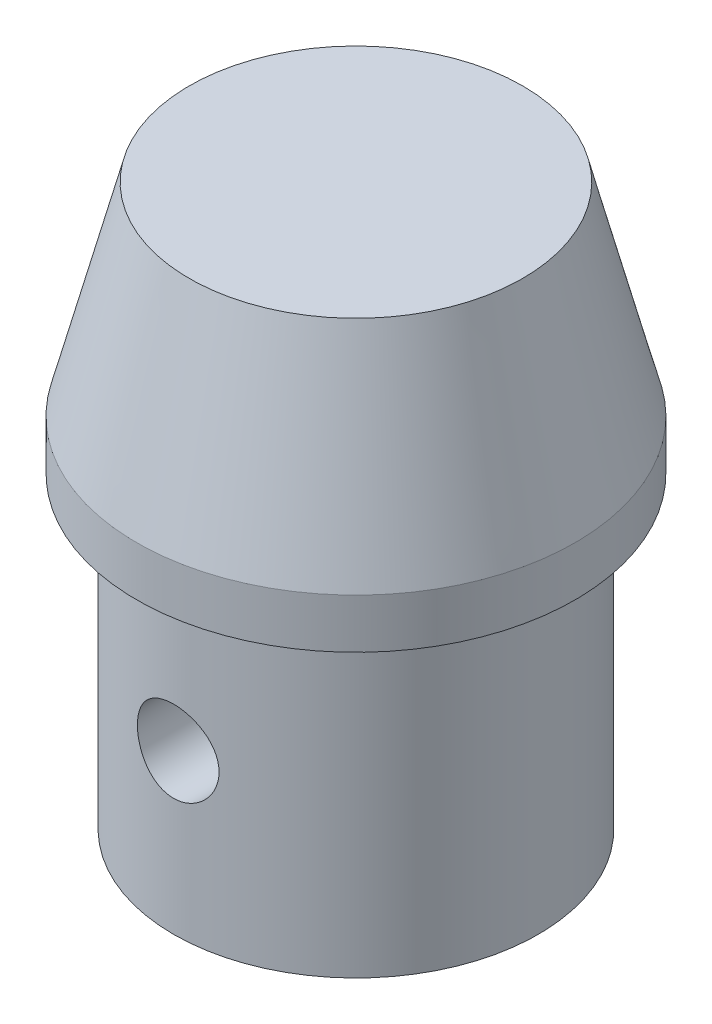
ISO-10303-21;
HEADER;
FILE_DESCRIPTION(('STEP AP214'),'2;1');
FILE_NAME('part.step','',(''),(''),'','','');
FILE_SCHEMA(('AUTOMOTIVE_DESIGN { 1 0 10303 214 1 1 1 1 }'));
ENDSEC;
DATA;
#1=APPLICATION_CONTEXT('core data for automotive mechanical design processes');
#2=APPLICATION_PROTOCOL_DEFINITION('international standard','automotive_design',2000,#1);
#3=PRODUCT_CONTEXT('',#1,'mechanical');
#4=PRODUCT('Part','Part','',(#3));
#5=PRODUCT_RELATED_PRODUCT_CATEGORY('part','',(#4));
#6=PRODUCT_DEFINITION_FORMATION('','',#4);
#7=PRODUCT_DEFINITION_CONTEXT('part definition',#1,'design');
#8=PRODUCT_DEFINITION('design','',#6,#7);
#9=PRODUCT_DEFINITION_SHAPE('','',#8);
#10=(LENGTH_UNIT() NAMED_UNIT(*) SI_UNIT(.MILLI.,.METRE.));
#11=(NAMED_UNIT(*) PLANE_ANGLE_UNIT() SI_UNIT($,.RADIAN.));
#12=(NAMED_UNIT(*) SI_UNIT($,.STERADIAN.) SOLID_ANGLE_UNIT());
#13=UNCERTAINTY_MEASURE_WITH_UNIT(LENGTH_MEASURE(1.E-05),#10,'distance_accuracy_value','');
#14=(GEOMETRIC_REPRESENTATION_CONTEXT(3) GLOBAL_UNCERTAINTY_ASSIGNED_CONTEXT((#13)) GLOBAL_UNIT_ASSIGNED_CONTEXT((#10,
#11,#12)) REPRESENTATION_CONTEXT('',''));
#15=CARTESIAN_POINT('',(0.,0.,0.));
#16=DIRECTION('',(0.,0.,1.));
#17=DIRECTION('',(1.,0.,0.));
#18=AXIS2_PLACEMENT_3D('',#15,#16,#17);
#19=CARTESIAN_POINT('',(0.,0.,0.));
#20=DIRECTION('',(0.,-1.,0.));
#21=DIRECTION('',(0.,0.,-1.));
#22=AXIS2_PLACEMENT_3D('',#19,#20,#21);
#23=PLANE('',#22);
#24=CARTESIAN_POINT('',(0.,0.,0.));
#25=DIRECTION('',(0.,-1.,0.));
#26=DIRECTION('',(0.,0.,-1.));
#27=AXIS2_PLACEMENT_3D('',#24,#25,#26);
#28=CIRCLE('',#27,7.2898);
#29=CARTESIAN_POINT('',(0.,0.,-7.2898));
#30=VERTEX_POINT('',#29);
#31=EDGE_CURVE('E10',#30,#30,#28,.T.);
#32=ORIENTED_EDGE('',*,*,#31,.T.);
#33=EDGE_LOOP('',(#32));
#34=FACE_BOUND('',#33,.T.);
#35=ADVANCED_FACE('F32',(#34),#23,.T.);
#36=CARTESIAN_POINT('',(0.,0.,0.));
#37=DIRECTION('',(0.,-1.,0.));
#38=DIRECTION('',(0.,0.,-1.));
#39=AXIS2_PLACEMENT_3D('',#36,#37,#38);
#40=CYLINDRICAL_SURFACE('',#39,7.2898);
#41=CARTESIAN_POINT('',(0.,7.9756,-7.2898));
#42=CARTESIAN_POINT('',(0.0904583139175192,7.9755969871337,-7.28979834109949));
#43=CARTESIAN_POINT('',(0.180952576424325,7.96805351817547,-7.28809921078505));
#44=CARTESIAN_POINT('',(0.359367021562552,7.93811242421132,-7.28148523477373));
#45=CARTESIAN_POINT('',(0.447285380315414,7.91570452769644,-7.27656816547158));
#46=CARTESIAN_POINT('',(0.61794409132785,7.85677446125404,-7.26406532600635));
#47=CARTESIAN_POINT('',(0.700689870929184,7.82026738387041,-7.25648241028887));
#48=CARTESIAN_POINT('',(0.858879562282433,7.73422399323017,-7.23946458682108));
#49=CARTESIAN_POINT('',(0.934323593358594,7.6846878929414,-7.23002970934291));
#50=CARTESIAN_POINT('',(1.07703522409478,7.57311414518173,-7.21016326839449));
#51=CARTESIAN_POINT('',(1.14416291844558,7.51089982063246,-7.19971885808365));
#52=CARTESIAN_POINT('',(1.26712280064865,7.37611479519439,-7.17910019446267));
#53=CARTESIAN_POINT('',(1.32295394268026,7.30354313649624,-7.16892596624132));
#54=CARTESIAN_POINT('',(1.42235946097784,7.14906097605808,-7.14987255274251));
#55=CARTESIAN_POINT('',(1.46578372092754,7.0670516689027,-7.14100980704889));
#56=CARTESIAN_POINT('',(1.53817952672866,6.89666833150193,-7.12576771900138));
#57=CARTESIAN_POINT('',(1.56715288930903,6.80829510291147,-7.11938806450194));
#58=CARTESIAN_POINT('',(1.60935974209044,6.62921353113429,-7.10996552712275));
#59=CARTESIAN_POINT('',(1.62284155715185,6.53856654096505,-7.10687006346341));
#60=CARTESIAN_POINT('',(1.63445497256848,6.35624858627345,-7.10420855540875));
#61=CARTESIAN_POINT('',(1.63258855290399,6.26457775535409,-7.10464205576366));
#62=CARTESIAN_POINT('',(1.61375804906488,6.08466911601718,-7.1089419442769));
#63=CARTESIAN_POINT('',(1.59708356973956,5.99639918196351,-7.11274247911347));
#64=CARTESIAN_POINT('',(1.54956958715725,5.82394227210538,-7.12324396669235));
#65=CARTESIAN_POINT('',(1.51872925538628,5.73975553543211,-7.12994508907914));
#66=CARTESIAN_POINT('',(1.4434961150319,5.57704651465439,-7.14555689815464));
#67=CARTESIAN_POINT('',(1.3989929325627,5.49857705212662,-7.15448546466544));
#68=CARTESIAN_POINT('',(1.29777491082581,5.35011303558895,-7.17353531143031));
#69=CARTESIAN_POINT('',(1.24105833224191,5.28011969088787,-7.18365676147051));
#70=CARTESIAN_POINT('',(1.11549558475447,5.148928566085,-7.20423368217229));
#71=CARTESIAN_POINT('',(1.04640343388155,5.08796634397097,-7.21469152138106));
#72=CARTESIAN_POINT('',(0.898856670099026,4.97845473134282,-7.23455410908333));
#73=CARTESIAN_POINT('',(0.820401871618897,4.92990558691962,-7.24395883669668));
#74=CARTESIAN_POINT('',(0.656061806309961,4.84653573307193,-7.26068838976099));
#75=CARTESIAN_POINT('',(0.570159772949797,4.81174703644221,-7.26800835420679));
#76=CARTESIAN_POINT('',(0.393528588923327,4.75716428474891,-7.27970764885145));
#77=CARTESIAN_POINT('',(0.302800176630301,4.73736794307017,-7.28408742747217));
#78=CARTESIAN_POINT('',(0.121111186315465,4.71367711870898,-7.28934864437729));
#79=CARTESIAN_POINT('',(0.0301945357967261,4.70946102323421,-7.29030082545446));
#80=CARTESIAN_POINT('',(-0.151044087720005,4.71617703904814,-7.28879830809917));
#81=CARTESIAN_POINT('',(-0.24136610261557,4.72710807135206,-7.28634385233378));
#82=CARTESIAN_POINT('',(-0.417777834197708,4.76354156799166,-7.27834860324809));
#83=CARTESIAN_POINT('',(-0.503904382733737,4.78887428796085,-7.27284378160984));
#84=CARTESIAN_POINT('',(-0.670685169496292,4.85320279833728,-7.25936443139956));
#85=CARTESIAN_POINT('',(-0.751338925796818,4.89219979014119,-7.25138968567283));
#86=CARTESIAN_POINT('',(-0.906206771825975,4.98341259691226,-7.2336812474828));
#87=CARTESIAN_POINT('',(-0.980307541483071,5.03581598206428,-7.22392320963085));
#88=CARTESIAN_POINT('',(-1.11877886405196,5.15210820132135,-7.2037783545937));
#89=CARTESIAN_POINT('',(-1.18314808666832,5.21599860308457,-7.19339145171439));
#90=CARTESIAN_POINT('',(-1.30160920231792,5.35493010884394,-7.17291353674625));
#91=CARTESIAN_POINT('',(-1.35547789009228,5.43016321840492,-7.16283215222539));
#92=CARTESIAN_POINT('',(-1.44981794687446,5.58879674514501,-7.14433568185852));
#93=CARTESIAN_POINT('',(-1.49028990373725,5.67219680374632,-7.13592052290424));
#94=CARTESIAN_POINT('',(-1.55640821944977,5.84434529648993,-7.12179200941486));
#95=CARTESIAN_POINT('',(-1.58213927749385,5.93305987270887,-7.11606325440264));
#96=CARTESIAN_POINT('',(-1.61829044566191,6.11369910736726,-7.10793005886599));
#97=CARTESIAN_POINT('',(-1.62871313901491,6.20562322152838,-7.10552505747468));
#98=CARTESIAN_POINT('',(-1.63383773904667,6.3878186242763,-7.10434820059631));
#99=CARTESIAN_POINT('',(-1.62889394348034,6.47807959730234,-7.10549446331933));
#100=CARTESIAN_POINT('',(-1.60422089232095,6.65644704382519,-7.11110515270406));
#101=CARTESIAN_POINT('',(-1.58449182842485,6.7445535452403,-7.115569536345));
#102=CARTESIAN_POINT('',(-1.53098309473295,6.91581341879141,-7.1272726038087));
#103=CARTESIAN_POINT('',(-1.49725731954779,6.99898440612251,-7.13450063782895));
#104=CARTESIAN_POINT('',(-1.41675797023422,7.15853942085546,-7.1509202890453));
#105=CARTESIAN_POINT('',(-1.36998296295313,7.23492270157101,-7.16011212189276));
#106=CARTESIAN_POINT('',(-1.2635478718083,7.38047535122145,-7.17966655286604));
#107=CARTESIAN_POINT('',(-1.20363630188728,7.4494580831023,-7.19004979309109));
#108=CARTESIAN_POINT('',(-1.07313544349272,7.57650684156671,-7.21068097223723));
#109=CARTESIAN_POINT('',(-1.00254368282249,7.63457033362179,-7.22092887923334));
#110=CARTESIAN_POINT('',(-0.851517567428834,7.73889825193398,-7.24030184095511));
#111=CARTESIAN_POINT('',(-0.770961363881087,7.78498970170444,-7.24940954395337));
#112=CARTESIAN_POINT('',(-0.603056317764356,7.86290460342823,-7.26530063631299));
#113=CARTESIAN_POINT('',(-0.515713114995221,7.89473975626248,-7.27208593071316));
#114=CARTESIAN_POINT('',(-0.35693107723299,7.9377098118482,-7.28138876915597));
#115=CARTESIAN_POINT('',(-0.286336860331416,7.95189098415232,-7.28452312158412));
#116=CARTESIAN_POINT('',(-0.143835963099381,7.97083704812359,-7.28872934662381));
#117=CARTESIAN_POINT('',(-0.0719293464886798,7.97560239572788,-7.28980131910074));
#118=CARTESIAN_POINT('',(0.,7.9756,-7.2898));
#119=B_SPLINE_CURVE_WITH_KNOTS('',3,(#41,#42,#43,#44,#45,#46,#47,#48,#49,#50,#51,#52,#53,#54,
#55,#56,#57,#58,#59,#60,#61,#62,#63,#64,#65,#66,#67,#68,#69,#70,#71,#72,#73,#74,#75,#76,#77,#78,
#79,#80,#81,#82,#83,#84,#85,#86,#87,#88,#89,#90,#91,#92,#93,#94,#95,#96,#97,#98,#99,#100,#101,
#102,#103,#104,#105,#106,#107,#108,#109,#110,#111,#112,#113,#114,#115,#116,#117,#118),
.UNSPECIFIED.,.T.,.F.,(4,2,2,2,2,2,2,2,2,2,2,2,2,2,2,2,2,2,2,2,2,2,2,2,2,2,2,2,2,2,2,2,2,2,2,2,
2,2,4),(0.,0.271111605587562,0.542410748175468,0.813420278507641,1.08442537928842,
1.35950292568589,1.63460592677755,1.91290875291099,2.19117658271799,2.46491874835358,
2.73862560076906,3.0070945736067,3.27557925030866,3.54629261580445,3.81704455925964,
4.09393876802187,4.37083846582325,4.64837861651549,4.92587642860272,5.19761298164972,
5.46933017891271,5.73790929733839,6.00651203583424,6.27910063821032,6.55172646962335,
6.82963268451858,7.10752670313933,7.38380753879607,7.66004174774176,7.92995458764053,
8.19986392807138,8.46874348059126,8.73765257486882,9.01224638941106,9.28690386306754,
9.56533299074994,9.84353317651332,10.0591222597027,10.2747009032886),.UNSPECIFIED.);
#120=CARTESIAN_POINT('',(0.,7.9756,-7.2898));
#121=VERTEX_POINT('',#120);
#122=EDGE_CURVE('E35',#121,#121,#119,.T.);
#123=ORIENTED_EDGE('',*,*,#122,.F.);
#124=EDGE_LOOP('',(#123));
#125=FACE_BOUND('',#124,.T.);
#126=CARTESIAN_POINT('',(1.63195,6.34365000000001,7.10478171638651));
#127=CARTESIAN_POINT('',(1.63194696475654,6.43407629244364,7.10478354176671));
#128=CARTESIAN_POINT('',(1.62440865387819,6.52453858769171,7.10652688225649));
#129=CARTESIAN_POINT('',(1.59448990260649,6.7028866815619,7.11329830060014));
#130=CARTESIAN_POINT('',(1.57209906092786,6.7907706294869,7.11832868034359));
#131=CARTESIAN_POINT('',(1.51321884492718,6.9613564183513,7.13107655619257));
#132=CARTESIAN_POINT('',(1.47674536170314,7.04406397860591,7.13879102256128));
#133=CARTESIAN_POINT('',(1.39078118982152,7.20218909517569,7.15603418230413));
#134=CARTESIAN_POINT('',(1.34129063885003,7.27760672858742,7.16556285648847));
#135=CARTESIAN_POINT('',(1.22976384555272,7.42034591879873,7.18554913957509));
#136=CARTESIAN_POINT('',(1.16754068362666,7.48751972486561,7.19601910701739));
#137=CARTESIAN_POINT('',(1.0327183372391,7.61056924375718,7.21660023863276));
#138=CARTESIAN_POINT('',(0.960118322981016,7.66644405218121,7.22671137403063));
#139=CARTESIAN_POINT('',(0.805609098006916,7.76589708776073,7.24557052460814));
#140=CARTESIAN_POINT('',(0.723605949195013,7.80933272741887,7.25430225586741));
#141=CARTESIAN_POINT('',(0.553235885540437,7.88175124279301,7.26927895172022));
#142=CARTESIAN_POINT('',(0.464869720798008,7.91073581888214,7.27552420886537));
#143=CARTESIAN_POINT('',(0.285818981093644,7.95296339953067,7.28473694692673));
#144=CARTESIAN_POINT('',(0.19519613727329,7.96645660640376,7.28775646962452));
#145=CARTESIAN_POINT('',(0.0129261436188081,7.97810118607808,7.29035799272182));
#146=CARTESIAN_POINT('',(-0.0787208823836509,7.97625439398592,7.28994040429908));
#147=CARTESIAN_POINT('',(-0.258711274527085,7.95745675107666,7.28575436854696));
#148=CARTESIAN_POINT('',(-0.347084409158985,7.94077564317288,7.2820457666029));
#149=CARTESIAN_POINT('',(-0.51974421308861,7.89321330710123,7.27176281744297));
#150=CARTESIAN_POINT('',(-0.604030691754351,7.86233141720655,7.26518833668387));
#151=CARTESIAN_POINT('',(-0.766867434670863,7.78700876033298,7.24981682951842));
#152=CARTESIAN_POINT('',(-0.845369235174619,7.74246672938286,7.24100329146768));
#153=CARTESIAN_POINT('',(-0.993881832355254,7.64116387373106,7.22211849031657));
#154=CARTESIAN_POINT('',(-1.063891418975,7.58440131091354,7.21204704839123));
#155=CARTESIAN_POINT('',(-1.19503740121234,7.45880352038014,7.19149345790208));
#156=CARTESIAN_POINT('',(-1.25594728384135,7.38973224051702,7.18100714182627));
#157=CARTESIAN_POINT('',(-1.36536291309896,7.24224666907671,7.16101046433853));
#158=CARTESIAN_POINT('',(-1.41386829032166,7.16383209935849,7.15150013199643));
#159=CARTESIAN_POINT('',(-1.49720540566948,6.99950760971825,7.13452052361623));
#160=CARTESIAN_POINT('',(-1.53199253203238,6.91357432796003,7.12705793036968));
#161=CARTESIAN_POINT('',(-1.58656280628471,6.73687457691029,7.11511005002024));
#162=CARTESIAN_POINT('',(-1.60634846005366,6.64610891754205,7.11062426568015));
#163=CARTESIAN_POINT('',(-1.6299990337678,6.46439549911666,7.10523979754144));
#164=CARTESIAN_POINT('',(-1.63419456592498,6.3734929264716,7.10426663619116));
#165=CARTESIAN_POINT('',(-1.6274424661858,6.19228719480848,7.10581640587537));
#166=CARTESIAN_POINT('',(-1.61649592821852,6.10198399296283,7.10833908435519));
#167=CARTESIAN_POINT('',(-1.58005776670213,5.92570330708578,7.11652579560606));
#168=CARTESIAN_POINT('',(-1.55474983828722,5.83968583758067,7.12215013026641));
#169=CARTESIAN_POINT('',(-1.49050692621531,5.67311237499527,7.13587032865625));
#170=CARTESIAN_POINT('',(-1.4515705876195,5.59255692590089,7.14396643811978));
#171=CARTESIAN_POINT('',(-1.3604534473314,5.43776809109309,7.16188052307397));
#172=CARTESIAN_POINT('',(-1.30806991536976,5.36365706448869,7.17172407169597));
#173=CARTESIAN_POINT('',(-1.19180922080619,5.2251559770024,7.19195722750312));
#174=CARTESIAN_POINT('',(-1.12793055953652,5.16076718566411,7.20234690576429));
#175=CARTESIAN_POINT('',(-0.988993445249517,5.04224638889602,7.22274825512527));
#176=CARTESIAN_POINT('',(-0.913740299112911,4.9883403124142,7.23274851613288));
#177=CARTESIAN_POINT('',(-0.755055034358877,4.89393467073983,7.25103062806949));
#178=CARTESIAN_POINT('',(-0.67162330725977,4.8534344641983,7.25931256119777));
#179=CARTESIAN_POINT('',(-0.499480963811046,4.78730052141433,7.27317694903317));
#180=CARTESIAN_POINT('',(-0.410808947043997,4.7615701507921,7.27877691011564));
#181=CARTESIAN_POINT('',(-0.230260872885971,4.72540600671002,7.28672224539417));
#182=CARTESIAN_POINT('',(-0.138385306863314,4.71496989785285,7.28906811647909));
#183=CARTESIAN_POINT('',(0.0438207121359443,4.7097996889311,7.29022533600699));
#184=CARTESIAN_POINT('',(0.134141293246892,4.71472891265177,7.28911247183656));
#185=CARTESIAN_POINT('',(0.312631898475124,4.73939355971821,7.28364052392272));
#186=CARTESIAN_POINT('',(0.400801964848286,4.75912869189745,7.2792815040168));
#187=CARTESIAN_POINT('',(0.572213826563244,4.81268040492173,7.26781361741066));
#188=CARTESIAN_POINT('',(0.655471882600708,4.84644715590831,7.26071448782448));
#189=CARTESIAN_POINT('',(0.8151844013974,4.9270557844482,7.24452271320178));
#190=CARTESIAN_POINT('',(0.891638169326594,4.97389899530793,7.23542986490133));
#191=CARTESIAN_POINT('',(1.03720726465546,5.08041759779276,7.21601621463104));
#192=CARTESIAN_POINT('',(1.10614750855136,5.14032850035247,7.20567467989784));
#193=CARTESIAN_POINT('',(1.23311087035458,5.27080950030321,7.18503782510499));
#194=CARTESIAN_POINT('',(1.29113133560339,5.34138218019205,7.17474251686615));
#195=CARTESIAN_POINT('',(1.3954021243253,5.49238528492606,7.15520078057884));
#196=CARTESIAN_POINT('',(1.44147420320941,5.57294111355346,7.14597126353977));
#197=CARTESIAN_POINT('',(1.51935298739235,5.74084311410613,7.12982078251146));
#198=CARTESIAN_POINT('',(1.55117150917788,5.82818359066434,7.12289790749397));
#199=CARTESIAN_POINT('',(1.59410361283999,5.98692386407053,7.1133943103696));
#200=CARTESIAN_POINT('',(1.60826823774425,6.05747678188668,7.11018645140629));
#201=CARTESIAN_POINT('',(1.62719238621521,6.19989559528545,7.10587948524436));
#202=CARTESIAN_POINT('',(1.63195241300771,6.2717614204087,7.10478026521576));
#203=CARTESIAN_POINT('',(1.63195,6.34365000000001,7.10478171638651));
#204=B_SPLINE_CURVE_WITH_KNOTS('',3,(#126,#127,#128,#129,#130,#131,#132,#133,#134,#135,#136,
#137,#138,#139,#140,#141,#142,#143,#144,#145,#146,#147,#148,#149,#150,#151,#152,#153,#154,#155,
#156,#157,#158,#159,#160,#161,#162,#163,#164,#165,#166,#167,#168,#169,#170,#171,#172,#173,#174,
#175,#176,#177,#178,#179,#180,#181,#182,#183,#184,#185,#186,#187,#188,#189,#190,#191,#192,#193,
#194,#195,#196,#197,#198,#199,#200,#201,#202,#203),.UNSPECIFIED.,.T.,.F.,(4,2,2,2,2,2,2,2,2,2,2,
2,2,2,2,2,2,2,2,2,2,2,2,2,2,2,2,2,2,2,2,2,2,2,2,2,2,2,4),(0.,0.271015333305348,
0.542220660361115,0.813120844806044,1.08401816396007,1.35922163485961,1.63444712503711,
1.91271157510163,2.19094327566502,2.46461505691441,2.73825409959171,3.0070168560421,
3.27579213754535,3.54661011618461,3.81746663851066,4.09422342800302,4.37098845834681,
4.6486462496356,4.92625765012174,5.19794714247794,5.46961700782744,5.73788786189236,
6.00618539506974,6.2787932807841,6.55143673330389,6.8294274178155,7.10740480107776,
7.38354210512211,7.65963723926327,7.92972559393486,8.19980863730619,8.46894063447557,
8.73810008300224,9.01258394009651,9.28713438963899,9.56557136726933,9.84377708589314,
10.0592448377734,10.2747010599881),.UNSPECIFIED.);
#205=CARTESIAN_POINT('',(1.63195,6.34365000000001,7.10478171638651));
#206=VERTEX_POINT('',#205);
#207=EDGE_CURVE('E51',#206,#206,#204,.T.);
#208=ORIENTED_EDGE('',*,*,#207,.F.);
#209=EDGE_LOOP('',(#208));
#210=FACE_BOUND('',#209,.T.);
#211=CARTESIAN_POINT('',(0.,12.319,0.));
#212=DIRECTION('',(0.,-1.,0.));
#213=DIRECTION('',(0.,0.,-1.));
#214=AXIS2_PLACEMENT_3D('',#211,#212,#213);
#215=CIRCLE('',#214,7.2898);
#216=CARTESIAN_POINT('',(0.,12.319,-7.2898));
#217=VERTEX_POINT('',#216);
#218=EDGE_CURVE('E43',#217,#217,#215,.T.);
#219=ORIENTED_EDGE('',*,*,#218,.T.);
#220=EDGE_LOOP('',(#219));
#221=FACE_BOUND('',#220,.T.);
#222=ORIENTED_EDGE('',*,*,#31,.F.);
#223=EDGE_LOOP('',(#222));
#224=FACE_BOUND('',#223,.T.);
#225=ADVANCED_FACE('F56',(#125,#210,#221,#224),#40,.T.);
#226=CARTESIAN_POINT('',(7.2898,12.319,0.));
#227=DIRECTION('',(0.,-1.,0.));
#228=DIRECTION('',(0.,0.,-1.));
#229=AXIS2_PLACEMENT_3D('',#226,#227,#228);
#230=PLANE('',#229);
#231=CARTESIAN_POINT('',(0.,12.319,0.));
#232=DIRECTION('',(0.,-1.,0.));
#233=DIRECTION('',(0.,0.,-1.));
#234=AXIS2_PLACEMENT_3D('',#231,#232,#233);
#235=CIRCLE('',#234,8.763);
#236=CARTESIAN_POINT('',(0.,12.319,-8.763));
#237=VERTEX_POINT('',#236);
#238=EDGE_CURVE('E48',#237,#237,#235,.T.);
#239=ORIENTED_EDGE('',*,*,#238,.T.);
#240=EDGE_LOOP('',(#239));
#241=FACE_BOUND('',#240,.T.);
#242=ORIENTED_EDGE('',*,*,#218,.F.);
#243=EDGE_LOOP('',(#242));
#244=FACE_BOUND('',#243,.T.);
#245=ADVANCED_FACE('F75',(#241,#244),#230,.T.);
#246=CARTESIAN_POINT('',(0.,0.,0.));
#247=DIRECTION('',(0.,-1.,0.));
#248=DIRECTION('',(0.,0.,-1.));
#249=AXIS2_PLACEMENT_3D('',#246,#247,#248);
#250=CYLINDRICAL_SURFACE('',#249,8.763);
#251=CARTESIAN_POINT('',(0.,14.3002,0.));
#252=DIRECTION('',(0.,-1.,0.));
#253=DIRECTION('',(0.,0.,-1.));
#254=AXIS2_PLACEMENT_3D('',#251,#252,#253);
#255=CIRCLE('',#254,8.763);
#256=CARTESIAN_POINT('',(0.,14.3002,-8.763));
#257=VERTEX_POINT('',#256);
#258=EDGE_CURVE('E131',#257,#257,#255,.T.);
#259=ORIENTED_EDGE('',*,*,#258,.T.);
#260=EDGE_LOOP('',(#259));
#261=FACE_BOUND('',#260,.T.);
#262=ORIENTED_EDGE('',*,*,#238,.F.);
#263=EDGE_LOOP('',(#262));
#264=FACE_BOUND('',#263,.T.);
#265=ADVANCED_FACE('F72',(#261,#264),#250,.T.);
#266=CARTESIAN_POINT('',(0.,14.3002,0.));
#267=DIRECTION('',(0.,-1.,0.));
#268=DIRECTION('',(0.,0.,-1.));
#269=AXIS2_PLACEMENT_3D('',#266,#267,#268);
#270=CONICAL_SURFACE('',#269,8.763,0.253075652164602);
#271=CARTESIAN_POINT('',(0.,22.4028,0.));
#272=DIRECTION('',(0.,-1.,0.));
#273=DIRECTION('',(0.,0.,-1.));
#274=AXIS2_PLACEMENT_3D('',#271,#272,#273);
#275=CIRCLE('',#274,6.6675);
#276=CARTESIAN_POINT('',(0.,22.4028,-6.6675));
#277=VERTEX_POINT('',#276);
#278=EDGE_CURVE('E133',#277,#277,#275,.T.);
#279=ORIENTED_EDGE('',*,*,#278,.T.);
#280=EDGE_LOOP('',(#279));
#281=FACE_BOUND('',#280,.T.);
#282=ORIENTED_EDGE('',*,*,#258,.F.);
#283=EDGE_LOOP('',(#282));
#284=FACE_BOUND('',#283,.T.);
#285=ADVANCED_FACE('F68',(#281,#284),#270,.T.);
#286=CARTESIAN_POINT('',(6.6675,22.4028,0.));
#287=DIRECTION('',(0.,1.,0.));
#288=DIRECTION('',(0.,0.,1.));
#289=AXIS2_PLACEMENT_3D('',#286,#287,#288);
#290=PLANE('',#289);
#291=ORIENTED_EDGE('',*,*,#278,.F.);
#292=EDGE_LOOP('',(#291));
#293=FACE_BOUND('',#292,.T.);
#294=ADVANCED_FACE('F63',(#293),#290,.T.);
#295=CARTESIAN_POINT('',(0.,6.34365000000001,-20.32));
#296=DIRECTION('',(0.,0.,1.));
#297=DIRECTION('',(1.,0.,0.));
#298=AXIS2_PLACEMENT_3D('',#295,#296,#297);
#299=CYLINDRICAL_SURFACE('',#298,1.63195);
#300=ORIENTED_EDGE('',*,*,#122,.T.);
#301=EDGE_LOOP('',(#300));
#302=FACE_BOUND('',#301,.T.);
#303=ORIENTED_EDGE('',*,*,#207,.T.);
#304=EDGE_LOOP('',(#303));
#305=FACE_BOUND('',#304,.T.);
#306=ADVANCED_FACE('F59',(#302,#305),#299,.F.);
#307=CLOSED_SHELL('',(#35,#225,#245,#265,#285,#294,#306));
#308=MANIFOLD_SOLID_BREP('B2',#307);
#309=ADVANCED_BREP_SHAPE_REPRESENTATION('',(#18,#308),#14);
#310=SHAPE_DEFINITION_REPRESENTATION(#9,#309);
ENDSEC;
END-ISO-10303-21;
